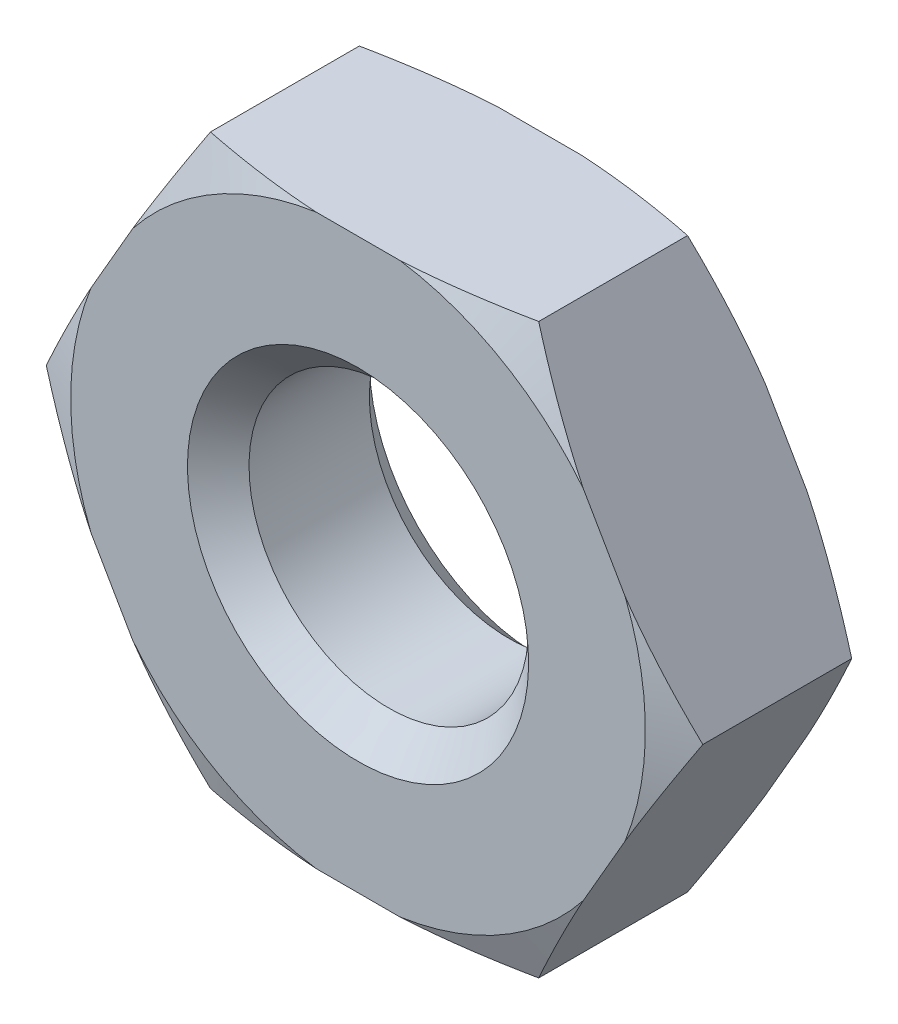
ISO-10303-21;
HEADER;
FILE_DESCRIPTION(('STEP AP214'),'2;1');
FILE_NAME('part.step','',(''),(''),'','','');
FILE_SCHEMA(('AUTOMOTIVE_DESIGN { 1 0 10303 214 1 1 1 1 }'));
ENDSEC;
DATA;
#1=APPLICATION_CONTEXT('core data for automotive mechanical design processes');
#2=APPLICATION_PROTOCOL_DEFINITION('international standard','automotive_design',2000,#1);
#3=PRODUCT_CONTEXT('',#1,'mechanical');
#4=PRODUCT('Part','Part','',(#3));
#5=PRODUCT_RELATED_PRODUCT_CATEGORY('part','',(#4));
#6=PRODUCT_DEFINITION_FORMATION('','',#4);
#7=PRODUCT_DEFINITION_CONTEXT('part definition',#1,'design');
#8=PRODUCT_DEFINITION('design','',#6,#7);
#9=PRODUCT_DEFINITION_SHAPE('','',#8);
#10=(LENGTH_UNIT() NAMED_UNIT(*) SI_UNIT(.MILLI.,.METRE.));
#11=(NAMED_UNIT(*) PLANE_ANGLE_UNIT() SI_UNIT($,.RADIAN.));
#12=(NAMED_UNIT(*) SI_UNIT($,.STERADIAN.) SOLID_ANGLE_UNIT());
#13=UNCERTAINTY_MEASURE_WITH_UNIT(LENGTH_MEASURE(1.E-05),#10,'distance_accuracy_value','');
#14=(GEOMETRIC_REPRESENTATION_CONTEXT(3) GLOBAL_UNCERTAINTY_ASSIGNED_CONTEXT((#13)) GLOBAL_UNIT_ASSIGNED_CONTEXT((#10,
#11,#12)) REPRESENTATION_CONTEXT('',''));
#15=CARTESIAN_POINT('',(0.,0.,0.));
#16=DIRECTION('',(0.,0.,1.));
#17=DIRECTION('',(1.,0.,0.));
#18=AXIS2_PLACEMENT_3D('',#15,#16,#17);
#19=CARTESIAN_POINT('',(0.,0.,0.));
#20=DIRECTION('',(0.,0.,1.));
#21=DIRECTION('',(0.,-1.,0.));
#22=AXIS2_PLACEMENT_3D('',#19,#20,#21);
#23=CONICAL_SURFACE('',#22,5.05347473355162,1.18682389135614);
#24=CARTESIAN_POINT('',(4.69673964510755,1.86500364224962,-2.00000000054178E-07));
#25=CARTESIAN_POINT('',(4.78728230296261,1.70817915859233,0.0105818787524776));
#26=CARTESIAN_POINT('',(4.87769671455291,1.55157680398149,0.0250669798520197));
#27=CARTESIAN_POINT('',(5.05806042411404,1.23917769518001,0.0611124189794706));
#28=CARTESIAN_POINT('',(5.1480101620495,1.08338017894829,0.0826638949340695));
#29=CARTESIAN_POINT('',(5.32744099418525,0.772596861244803,0.132135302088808));
#30=CARTESIAN_POINT('',(5.4169221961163,0.617610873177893,0.16005369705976));
#31=CARTESIAN_POINT('',(5.59552040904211,0.30826969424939,0.221487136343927));
#32=CARTESIAN_POINT('',(5.68463682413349,0.153915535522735,0.255009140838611));
#33=CARTESIAN_POINT('',(5.77350011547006,-2.0000000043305E-07,0.290909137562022));
#34=B_SPLINE_CURVE_WITH_KNOTS('',3,(#24,#25,#26,#27,#28,#29,#30,#31,#32,#33),.UNSPECIFIED.,.F.,
.F.,(4,2,2,2,4),(0.,0.544100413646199,1.08752105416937,1.63081071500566,2.17478027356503),.UNSPECIFIED.);
#35=CARTESIAN_POINT('',(4.6967413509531,1.86500068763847,0.));
#36=VERTEX_POINT('',#35);
#37=CARTESIAN_POINT('',(5.7735,0.,0.290909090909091));
#38=VERTEX_POINT('',#37);
#39=EDGE_CURVE('E301',#36,#38,#34,.T.);
#40=ORIENTED_EDGE('',*,*,#39,.T.);
#41=CARTESIAN_POINT('',(5.77350011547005,2.E-07,0.290909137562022));
#42=CARTESIAN_POINT('',(5.68463682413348,-0.153915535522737,0.255009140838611));
#43=CARTESIAN_POINT('',(5.59552040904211,-0.308269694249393,0.221487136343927));
#44=CARTESIAN_POINT('',(5.4169221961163,-0.617610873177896,0.16005369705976));
#45=CARTESIAN_POINT('',(5.32744099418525,-0.772596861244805,0.132135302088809));
#46=CARTESIAN_POINT('',(5.1480101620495,-1.0833801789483,0.0826638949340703));
#47=CARTESIAN_POINT('',(5.05806042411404,-1.23917769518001,0.0611124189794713));
#48=CARTESIAN_POINT('',(4.87769671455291,-1.55157680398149,0.0250669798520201));
#49=CARTESIAN_POINT('',(4.78728230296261,-1.70817915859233,0.0105818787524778));
#50=CARTESIAN_POINT('',(4.69673964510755,-1.86500364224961,-1.99999999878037E-07));
#51=B_SPLINE_CURVE_WITH_KNOTS('',3,(#41,#42,#43,#44,#45,#46,#47,#48,#49,#50),.UNSPECIFIED.,.F.,
.F.,(4,2,2,2,4),(0.,0.543969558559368,1.08725921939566,1.63067985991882,2.17478027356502),.UNSPECIFIED.);
#52=CARTESIAN_POINT('',(4.6967413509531,-1.86500068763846,0.));
#53=VERTEX_POINT('',#52);
#54=EDGE_CURVE('E34',#38,#53,#51,.T.);
#55=ORIENTED_EDGE('',*,*,#54,.T.);
#56=CARTESIAN_POINT('',(0.,0.,0.));
#57=DIRECTION('',(0.,0.,1.));
#58=DIRECTION('',(1.,0.,0.));
#59=AXIS2_PLACEMENT_3D('',#56,#57,#58);
#60=CIRCLE('',#59,5.05347473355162);
#61=EDGE_CURVE('E309',#53,#36,#60,.T.);
#62=ORIENTED_EDGE('',*,*,#61,.T.);
#63=EDGE_LOOP('',(#40,#55,#62));
#64=FACE_BOUND('',#63,.T.);
#65=ADVANCED_FACE('F17',(#64),#23,.T.);
#66=CARTESIAN_POINT('',(5.7735,0.,0.));
#67=DIRECTION('',(0.,0.,1.));
#68=DIRECTION('',(1.,0.,0.));
#69=AXIS2_PLACEMENT_3D('',#66,#67,#68);
#70=PLANE('',#69);
#71=CARTESIAN_POINT('',(0.,0.,0.));
#72=DIRECTION('',(0.,0.,-1.));
#73=DIRECTION('',(0.,1.,0.));
#74=AXIS2_PLACEMENT_3D('',#71,#72,#73);
#75=CIRCLE('',#74,5.05347473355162);
#76=CARTESIAN_POINT('',(0.733232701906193,4.99999766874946,0.));
#77=VERTEX_POINT('',#76);
#78=CARTESIAN_POINT('',(3.9635086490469,3.134996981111,0.));
#79=VERTEX_POINT('',#78);
#80=EDGE_CURVE('E152',#77,#79,#75,.T.);
#81=ORIENTED_EDGE('',*,*,#80,.T.);
#82=DIRECTION('',(-0.5,0.866025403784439,0.));
#83=VECTOR('',#82,1.);
#84=CARTESIAN_POINT('',(5.7735,0.,0.));
#85=LINE('',#84,#83);
#86=EDGE_CURVE('E158',#36,#79,#85,.T.);
#87=ORIENTED_EDGE('',*,*,#86,.F.);
#88=ORIENTED_EDGE('',*,*,#61,.F.);
#89=DIRECTION('',(0.5,0.866025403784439,0.));
#90=VECTOR('',#89,1.);
#91=CARTESIAN_POINT('',(2.88675,-4.99999766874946,0.));
#92=LINE('',#91,#90);
#93=CARTESIAN_POINT('',(3.9635086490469,-3.134996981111,0.));
#94=VERTEX_POINT('',#93);
#95=EDGE_CURVE('E346',#94,#53,#92,.T.);
#96=ORIENTED_EDGE('',*,*,#95,.F.);
#97=CARTESIAN_POINT('',(0.733232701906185,-4.99999766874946,0.));
#98=VERTEX_POINT('',#97);
#99=EDGE_CURVE('E310',#98,#94,#60,.T.);
#100=ORIENTED_EDGE('',*,*,#99,.F.);
#101=DIRECTION('',(1.,0.,0.));
#102=VECTOR('',#101,1.);
#103=CARTESIAN_POINT('',(-2.88675,-4.99999766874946,0.));
#104=LINE('',#103,#102);
#105=CARTESIAN_POINT('',(-0.733232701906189,-4.99999766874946,0.));
#106=VERTEX_POINT('',#105);
#107=EDGE_CURVE('E333',#106,#98,#104,.T.);
#108=ORIENTED_EDGE('',*,*,#107,.F.);
#109=CARTESIAN_POINT('',(-3.96350864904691,-3.13499698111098,0.));
#110=VERTEX_POINT('',#109);
#111=EDGE_CURVE('E313',#110,#106,#60,.T.);
#112=ORIENTED_EDGE('',*,*,#111,.F.);
#113=DIRECTION('',(0.5,-0.866025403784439,0.));
#114=VECTOR('',#113,1.);
#115=CARTESIAN_POINT('',(-5.7735,0.,0.));
#116=LINE('',#115,#114);
#117=CARTESIAN_POINT('',(-4.69674135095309,-1.86500068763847,0.));
#118=VERTEX_POINT('',#117);
#119=EDGE_CURVE('E330',#118,#110,#116,.T.);
#120=ORIENTED_EDGE('',*,*,#119,.F.);
#121=CARTESIAN_POINT('',(-4.69674135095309,1.86500068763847,0.));
#122=VERTEX_POINT('',#121);
#123=EDGE_CURVE('E315',#122,#118,#60,.T.);
#124=ORIENTED_EDGE('',*,*,#123,.F.);
#125=DIRECTION('',(-0.5,-0.866025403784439,0.));
#126=VECTOR('',#125,1.);
#127=CARTESIAN_POINT('',(-2.88675,4.99999766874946,0.));
#128=LINE('',#127,#126);
#129=CARTESIAN_POINT('',(-3.9635086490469,3.13499698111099,0.));
#130=VERTEX_POINT('',#129);
#131=EDGE_CURVE('E157',#130,#122,#128,.T.);
#132=ORIENTED_EDGE('',*,*,#131,.F.);
#133=CARTESIAN_POINT('',(-0.73323270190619,4.99999766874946,0.));
#134=VERTEX_POINT('',#133);
#135=EDGE_CURVE('E154',#134,#130,#60,.T.);
#136=ORIENTED_EDGE('',*,*,#135,.F.);
#137=DIRECTION('',(-1.,0.,0.));
#138=VECTOR('',#137,1.);
#139=CARTESIAN_POINT('',(2.88675,4.99999766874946,0.));
#140=LINE('',#139,#138);
#141=EDGE_CURVE('E147',#77,#134,#140,.T.);
#142=ORIENTED_EDGE('',*,*,#141,.F.);
#143=EDGE_LOOP('',(#81,#87,#88,#96,#100,#108,#112,#120,#124,#132,#136,#142));
#144=FACE_BOUND('',#143,.T.);
#145=CARTESIAN_POINT('',(0.,0.,0.));
#146=DIRECTION('',(0.,0.,-1.));
#147=DIRECTION('',(0.,1.,0.));
#148=AXIS2_PLACEMENT_3D('',#145,#146,#147);
#149=CIRCLE('',#148,3.);
#150=CARTESIAN_POINT('',(0.,3.,0.));
#151=VERTEX_POINT('',#150);
#152=EDGE_CURVE('E170',#151,#151,#149,.T.);
#153=ORIENTED_EDGE('',*,*,#152,.F.);
#154=EDGE_LOOP('',(#153));
#155=FACE_BOUND('',#154,.T.);
#156=ADVANCED_FACE('F149',(#144,#155),#70,.F.);
#157=CARTESIAN_POINT('',(2.88675,-4.99999766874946,3.2));
#158=DIRECTION('',(-0.866025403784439,0.5,0.));
#159=DIRECTION('',(-0.5,-0.866025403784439,0.));
#160=AXIS2_PLACEMENT_3D('',#157,#158,#159);
#161=PLANE('',#160);
#162=CARTESIAN_POINT('',(4.69673964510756,-1.86500364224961,3.2000002));
#163=CARTESIAN_POINT('',(4.78728230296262,-1.70817915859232,3.18941812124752));
#164=CARTESIAN_POINT('',(4.87769671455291,-1.55157680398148,3.17493302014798));
#165=CARTESIAN_POINT('',(5.05806042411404,-1.23917769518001,3.13888758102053));
#166=CARTESIAN_POINT('',(5.1480101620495,-1.08338017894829,3.11733610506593));
#167=CARTESIAN_POINT('',(5.32744099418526,-0.772596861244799,3.06786469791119));
#168=CARTESIAN_POINT('',(5.41692219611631,-0.61761087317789,3.03994630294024));
#169=CARTESIAN_POINT('',(5.59552040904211,-0.308269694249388,2.97851286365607));
#170=CARTESIAN_POINT('',(5.68463682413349,-0.153915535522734,2.94499085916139));
#171=CARTESIAN_POINT('',(5.77350011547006,1.99999999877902E-07,2.90909086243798));
#172=B_SPLINE_CURVE_WITH_KNOTS('',3,(#162,#163,#164,#165,#166,#167,#168,#169,#170,#171),
.UNSPECIFIED.,.F.,.F.,(4,2,2,2,4),(0.,0.544100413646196,1.08752105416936,1.63081071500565,
2.17478027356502),.UNSPECIFIED.);
#173=CARTESIAN_POINT('',(4.6967413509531,-1.86500068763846,3.2));
#174=VERTEX_POINT('',#173);
#175=CARTESIAN_POINT('',(5.7735,0.,2.90909090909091));
#176=VERTEX_POINT('',#175);
#177=EDGE_CURVE('E285',#174,#176,#172,.T.);
#178=ORIENTED_EDGE('',*,*,#177,.F.);
#179=DIRECTION('',(0.5,0.866025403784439,0.));
#180=VECTOR('',#179,1.);
#181=CARTESIAN_POINT('',(2.88675,-4.99999766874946,3.2));
#182=LINE('',#181,#180);
#183=CARTESIAN_POINT('',(3.9635086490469,-3.134996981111,3.2));
#184=VERTEX_POINT('',#183);
#185=EDGE_CURVE('E341',#184,#174,#182,.T.);
#186=ORIENTED_EDGE('',*,*,#185,.F.);
#187=CARTESIAN_POINT('',(2.88674988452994,-4.99999786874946,2.90909086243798));
#188=CARTESIAN_POINT('',(2.97561317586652,-4.84608213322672,2.94499085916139));
#189=CARTESIAN_POINT('',(3.06472959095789,-4.69172797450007,2.97851286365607));
#190=CARTESIAN_POINT('',(3.24332780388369,-4.38238679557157,3.03994630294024));
#191=CARTESIAN_POINT('',(3.33280900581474,-4.22740080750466,3.06786469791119));
#192=CARTESIAN_POINT('',(3.5122398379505,-3.91661748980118,3.11733610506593));
#193=CARTESIAN_POINT('',(3.60218957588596,-3.76081997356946,3.13888758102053));
#194=CARTESIAN_POINT('',(3.78255328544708,-3.44842086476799,3.17493302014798));
#195=CARTESIAN_POINT('',(3.87296769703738,-3.29181851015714,3.18941812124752));
#196=CARTESIAN_POINT('',(3.96351035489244,-3.13499402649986,3.2000002));
#197=B_SPLINE_CURVE_WITH_KNOTS('',3,(#187,#188,#189,#190,#191,#192,#193,#194,#195,#196),
.UNSPECIFIED.,.F.,.F.,(4,2,2,2,4),(0.,0.543969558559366,1.08725921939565,1.63067985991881,
2.17478027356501),.UNSPECIFIED.);
#198=CARTESIAN_POINT('',(2.88675,-4.99999766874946,2.90909090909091));
#199=VERTEX_POINT('',#198);
#200=EDGE_CURVE('E220',#199,#184,#197,.T.);
#201=ORIENTED_EDGE('',*,*,#200,.F.);
#202=DIRECTION('',(0.,0.,-1.));
#203=VECTOR('',#202,1.);
#204=CARTESIAN_POINT('',(2.88675,-4.99999766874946,3.2));
#205=LINE('',#204,#203);
#206=CARTESIAN_POINT('',(2.88675,-4.99999766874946,0.290909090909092));
#207=VERTEX_POINT('',#206);
#208=EDGE_CURVE('E363',#199,#207,#205,.T.);
#209=ORIENTED_EDGE('',*,*,#208,.T.);
#210=CARTESIAN_POINT('',(3.96351035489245,-3.13499402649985,-1.99999999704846E-07));
#211=CARTESIAN_POINT('',(3.87296769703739,-3.29181851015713,0.0105818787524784));
#212=CARTESIAN_POINT('',(3.78255328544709,-3.44842086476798,0.0250669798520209));
#213=CARTESIAN_POINT('',(3.60218957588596,-3.76081997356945,0.0611124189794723));
#214=CARTESIAN_POINT('',(3.5122398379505,-3.91661748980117,0.0826638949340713));
#215=CARTESIAN_POINT('',(3.33280900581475,-4.22740080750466,0.13213530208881));
#216=CARTESIAN_POINT('',(3.2433278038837,-4.38238679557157,0.160053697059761));
#217=CARTESIAN_POINT('',(3.06472959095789,-4.69172797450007,0.221487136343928));
#218=CARTESIAN_POINT('',(2.97561317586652,-4.84608213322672,0.255009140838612));
#219=CARTESIAN_POINT('',(2.88674988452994,-4.99999786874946,0.290909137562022));
#220=B_SPLINE_CURVE_WITH_KNOTS('',3,(#210,#211,#212,#213,#214,#215,#216,#217,#218,#219),
.UNSPECIFIED.,.F.,.F.,(4,2,2,2,4),(0.,0.544100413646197,1.08752105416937,1.63081071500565,
2.17478027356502),.UNSPECIFIED.);
#221=EDGE_CURVE('E428',#94,#207,#220,.T.);
#222=ORIENTED_EDGE('',*,*,#221,.F.);
#223=ORIENTED_EDGE('',*,*,#95,.T.);
#224=ORIENTED_EDGE('',*,*,#54,.F.);
#225=DIRECTION('',(0.,0.,-1.));
#226=VECTOR('',#225,1.);
#227=CARTESIAN_POINT('',(5.7735,0.,3.2));
#228=LINE('',#227,#226);
#229=EDGE_CURVE('E311',#176,#38,#228,.T.);
#230=ORIENTED_EDGE('',*,*,#229,.F.);
#231=EDGE_LOOP('',(#178,#186,#201,#209,#222,#223,#224,#230));
#232=FACE_BOUND('',#231,.T.);
#233=ADVANCED_FACE('F19',(#232),#161,.F.);
#234=CARTESIAN_POINT('',(5.7735,0.,3.2));
#235=DIRECTION('',(-0.866025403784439,-0.5,0.));
#236=DIRECTION('',(0.5,-0.866025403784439,0.));
#237=AXIS2_PLACEMENT_3D('',#234,#235,#236);
#238=PLANE('',#237);
#239=CARTESIAN_POINT('',(3.96351035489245,3.13499402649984,3.2000002));
#240=CARTESIAN_POINT('',(3.87296769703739,3.29181851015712,3.18941812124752));
#241=CARTESIAN_POINT('',(3.78255328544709,3.44842086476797,3.17493302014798));
#242=CARTESIAN_POINT('',(3.60218957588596,3.76081997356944,3.13888758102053));
#243=CARTESIAN_POINT('',(3.51223983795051,3.91661748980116,3.11733610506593));
#244=CARTESIAN_POINT('',(3.33280900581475,4.22740080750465,3.06786469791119));
#245=CARTESIAN_POINT('',(3.2433278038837,4.38238679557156,3.03994630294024));
#246=CARTESIAN_POINT('',(3.06472959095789,4.69172797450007,2.97851286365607));
#247=CARTESIAN_POINT('',(2.97561317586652,4.84608213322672,2.94499085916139));
#248=CARTESIAN_POINT('',(2.88674988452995,4.99999786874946,2.90909086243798));
#249=B_SPLINE_CURVE_WITH_KNOTS('',3,(#239,#240,#241,#242,#243,#244,#245,#246,#247,#248),
.UNSPECIFIED.,.F.,.F.,(4,2,2,2,4),(0.,0.544100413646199,1.08752105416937,1.63081071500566,
2.17478027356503),.UNSPECIFIED.);
#250=CARTESIAN_POINT('',(3.9635086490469,3.134996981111,3.2));
#251=VERTEX_POINT('',#250);
#252=CARTESIAN_POINT('',(2.88675,4.99999766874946,2.90909090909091));
#253=VERTEX_POINT('',#252);
#254=EDGE_CURVE('E276',#251,#253,#249,.T.);
#255=ORIENTED_EDGE('',*,*,#254,.F.);
#256=DIRECTION('',(-0.5,0.866025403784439,0.));
#257=VECTOR('',#256,1.);
#258=CARTESIAN_POINT('',(5.7735,0.,3.2));
#259=LINE('',#258,#257);
#260=CARTESIAN_POINT('',(4.6967413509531,1.86500068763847,3.2));
#261=VERTEX_POINT('',#260);
#262=EDGE_CURVE('E348',#261,#251,#259,.T.);
#263=ORIENTED_EDGE('',*,*,#262,.F.);
#264=CARTESIAN_POINT('',(5.77350011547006,-2.00000000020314E-07,2.90909086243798));
#265=CARTESIAN_POINT('',(5.68463682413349,0.153915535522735,2.94499085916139));
#266=CARTESIAN_POINT('',(5.59552040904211,0.30826969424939,2.97851286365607));
#267=CARTESIAN_POINT('',(5.4169221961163,0.617610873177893,3.03994630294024));
#268=CARTESIAN_POINT('',(5.32744099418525,0.772596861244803,3.06786469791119));
#269=CARTESIAN_POINT('',(5.1480101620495,1.08338017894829,3.11733610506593));
#270=CARTESIAN_POINT('',(5.05806042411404,1.23917769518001,3.13888758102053));
#271=CARTESIAN_POINT('',(4.87769671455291,1.55157680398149,3.17493302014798));
#272=CARTESIAN_POINT('',(4.78728230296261,1.70817915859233,3.18941812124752));
#273=CARTESIAN_POINT('',(4.69673964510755,1.86500364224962,3.2000002));
#274=B_SPLINE_CURVE_WITH_KNOTS('',3,(#264,#265,#266,#267,#268,#269,#270,#271,#272,#273),
.UNSPECIFIED.,.F.,.F.,(4,2,2,2,4),(0.,0.543969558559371,1.08725921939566,1.63067985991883,
2.17478027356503),.UNSPECIFIED.);
#275=EDGE_CURVE('E281',#176,#261,#274,.T.);
#276=ORIENTED_EDGE('',*,*,#275,.F.);
#277=ORIENTED_EDGE('',*,*,#229,.T.);
#278=ORIENTED_EDGE('',*,*,#39,.F.);
#279=ORIENTED_EDGE('',*,*,#86,.T.);
#280=CARTESIAN_POINT('',(2.88674988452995,4.99999786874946,0.290909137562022));
#281=CARTESIAN_POINT('',(2.97561317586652,4.84608213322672,0.255009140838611));
#282=CARTESIAN_POINT('',(3.06472959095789,4.69172797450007,0.221487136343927));
#283=CARTESIAN_POINT('',(3.2433278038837,4.38238679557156,0.16005369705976));
#284=CARTESIAN_POINT('',(3.33280900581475,4.22740080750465,0.132135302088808));
#285=CARTESIAN_POINT('',(3.51223983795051,3.91661748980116,0.0826638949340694));
#286=CARTESIAN_POINT('',(3.60218957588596,3.76081997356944,0.0611124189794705));
#287=CARTESIAN_POINT('',(3.78255328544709,3.44842086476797,0.0250669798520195));
#288=CARTESIAN_POINT('',(3.87296769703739,3.29181851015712,0.0105818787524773));
#289=CARTESIAN_POINT('',(3.96351035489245,3.13499402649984,-2.00000000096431E-07));
#290=B_SPLINE_CURVE_WITH_KNOTS('',3,(#280,#281,#282,#283,#284,#285,#286,#287,#288,#289),
.UNSPECIFIED.,.F.,.F.,(4,2,2,2,4),(0.,0.543969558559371,1.08725921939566,1.63067985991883,
2.17478027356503),.UNSPECIFIED.);
#291=CARTESIAN_POINT('',(2.88675,4.99999766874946,0.290909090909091));
#292=VERTEX_POINT('',#291);
#293=EDGE_CURVE('E42',#292,#79,#290,.T.);
#294=ORIENTED_EDGE('',*,*,#293,.F.);
#295=DIRECTION('',(0.,0.,-1.));
#296=VECTOR('',#295,1.);
#297=CARTESIAN_POINT('',(2.88675,4.99999766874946,3.2));
#298=LINE('',#297,#296);
#299=EDGE_CURVE('E164',#253,#292,#298,.T.);
#300=ORIENTED_EDGE('',*,*,#299,.F.);
#301=EDGE_LOOP('',(#255,#263,#276,#277,#278,#279,#294,#300));
#302=FACE_BOUND('',#301,.T.);
#303=ADVANCED_FACE('F290',(#302),#238,.F.);
#304=CARTESIAN_POINT('',(2.88675,4.99999766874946,3.2));
#305=DIRECTION('',(0.,-1.,0.));
#306=DIRECTION('',(1.,0.,0.));
#307=AXIS2_PLACEMENT_3D('',#304,#305,#306);
#308=PLANE('',#307);
#309=CARTESIAN_POINT('',(-7.6494870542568,4.99999766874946,1.54948857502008));
#310=CARTESIAN_POINT('',(-7.42376492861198,4.99999766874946,1.62580385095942));
#311=CARTESIAN_POINT('',(-7.19774364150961,4.99999766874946,1.70125051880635));
#312=CARTESIAN_POINT('',(-6.74494791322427,4.99999766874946,1.84992142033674));
#313=CARTESIAN_POINT('',(-6.51817340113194,4.99999766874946,1.92314543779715));
#314=CARTESIAN_POINT('',(-6.06321673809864,4.99999766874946,2.06704269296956));
#315=CARTESIAN_POINT('',(-5.83503251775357,4.99999766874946,2.13770941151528));
#316=CARTESIAN_POINT('',(-5.37763676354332,4.99999766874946,2.27562907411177));
#317=CARTESIAN_POINT('',(-5.14842525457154,4.99999766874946,2.34288210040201));
#318=CARTESIAN_POINT('',(-4.69172212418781,4.99999766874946,2.47228254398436));
#319=CARTESIAN_POINT('',(-4.46424595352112,4.99999766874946,2.53448422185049));
#320=CARTESIAN_POINT('',(-4.00791262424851,4.99999766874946,2.65366439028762));
#321=CARTESIAN_POINT('',(-3.7790554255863,4.99999766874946,2.71064272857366));
#322=CARTESIAN_POINT('',(-3.3199230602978,4.99999766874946,2.81802184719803));
#323=CARTESIAN_POINT('',(-3.0896487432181,4.99999766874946,2.86842622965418));
#324=CARTESIAN_POINT('',(-2.62746239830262,4.99999766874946,2.9611050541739));
#325=CARTESIAN_POINT('',(-2.39555048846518,4.99999766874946,3.00338007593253));
#326=CARTESIAN_POINT('',(-1.9776855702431,4.99999766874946,3.07040615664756));
#327=CARTESIAN_POINT('',(-1.79202529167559,4.99999766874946,3.09697287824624));
#328=CARTESIAN_POINT('',(-1.41982575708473,4.99999766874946,3.14295683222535));
#329=CARTESIAN_POINT('',(-1.23328657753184,4.99999766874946,3.16237467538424));
#330=CARTESIAN_POINT('',(-0.859662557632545,4.99999766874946,3.19329541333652));
#331=CARTESIAN_POINT('',(-0.672578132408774,4.99999766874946,3.20480325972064));
#332=CARTESIAN_POINT('',(-0.298078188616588,4.99999766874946,3.2194204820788));
#333=CARTESIAN_POINT('',(-0.110662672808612,4.99999766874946,3.22252992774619));
#334=CARTESIAN_POINT('',(0.265016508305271,4.99999766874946,3.22020109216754));
#335=CARTESIAN_POINT('',(0.453279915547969,4.99999766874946,3.21472161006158));
#336=CARTESIAN_POINT('',(0.829373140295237,4.99999766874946,3.19539105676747));
#337=CARTESIAN_POINT('',(1.01720295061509,4.99999766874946,3.18153984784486));
#338=CARTESIAN_POINT('',(1.39223727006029,4.99999766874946,3.14605004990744));
#339=CARTESIAN_POINT('',(1.57944130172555,4.99999766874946,3.12440647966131));
#340=CARTESIAN_POINT('',(1.95289971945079,4.99999766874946,3.07415251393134));
#341=CARTESIAN_POINT('',(2.13915410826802,4.99999766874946,3.04554213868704));
#342=CARTESIAN_POINT('',(2.54191943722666,4.99999766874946,2.97693307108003));
#343=CARTESIAN_POINT('',(2.75824063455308,4.99999766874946,2.93582777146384));
#344=CARTESIAN_POINT('',(3.18947161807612,4.99999766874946,2.84676566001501));
#345=CARTESIAN_POINT('',(3.404381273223,4.99999766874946,2.79880822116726));
#346=CARTESIAN_POINT('',(3.83297909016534,4.99999766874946,2.69728359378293));
#347=CARTESIAN_POINT('',(4.04666656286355,4.99999766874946,2.64371351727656));
#348=CARTESIAN_POINT('',(4.47284023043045,4.99999766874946,2.53204916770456));
#349=CARTESIAN_POINT('',(4.68532647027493,4.99999766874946,2.47395506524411));
#350=CARTESIAN_POINT('',(5.10982164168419,4.99999766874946,2.35394650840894));
#351=CARTESIAN_POINT('',(5.3218278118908,4.99999766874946,2.29202232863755));
#352=CARTESIAN_POINT('',(5.74494356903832,4.99999766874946,2.16518095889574));
#353=CARTESIAN_POINT('',(5.95605313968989,4.99999766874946,2.10026371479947));
#354=CARTESIAN_POINT('',(6.58811681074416,4.99999766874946,1.90191635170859));
#355=CARTESIAN_POINT('',(7.00793020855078,4.99999766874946,1.76485470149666));
#356=CARTESIAN_POINT('',(7.84262861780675,4.99999766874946,1.48509282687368));
#357=CARTESIAN_POINT('',(8.25752793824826,4.99999766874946,1.34243487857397));
#358=CARTESIAN_POINT('',(9.08575676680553,4.99999766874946,1.05254341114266));
#359=CARTESIAN_POINT('',(9.49908615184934,4.99999766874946,0.905309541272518));
#360=CARTESIAN_POINT('',(10.3217912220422,4.99999766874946,0.608534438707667));
#361=CARTESIAN_POINT('',(10.7311748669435,4.99999766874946,0.459015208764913));
#362=CARTESIAN_POINT('',(11.3445503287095,4.99999766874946,0.232921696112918));
#363=CARTESIAN_POINT('',(11.5488792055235,4.99999766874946,0.157259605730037));
#364=CARTESIAN_POINT('',(11.9573377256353,4.99999766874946,0.00540172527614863));
#365=CARTESIAN_POINT('',(12.1614673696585,4.99999766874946,-0.0707940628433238));
#366=CARTESIAN_POINT('',(12.365510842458,4.99999766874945,-0.147219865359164));
#367=B_SPLINE_CURVE_WITH_KNOTS('',3,(#309,#310,#311,#312,#313,#314,#315,#316,#317,#318,#319,
#320,#321,#322,#323,#324,#325,#326,#327,#328,#329,#330,#331,#332,#333,#334,#335,#336,#337,#338,
#339,#340,#341,#342,#343,#344,#345,#346,#347,#348,#349,#350,#351,#352,#353,#354,#355,#356,#357,
#358,#359,#360,#361,#362,#363,#364,#365,#366),.UNSPECIFIED.,.F.,.F.,(4,2,2,2,2,2,2,2,2,2,2,2,2,
2,2,2,2,2,2,2,2,2,2,2,2,2,2,2,4),(0.,0.714828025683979,1.42972536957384,2.14633243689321,
2.86292223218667,3.57035502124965,4.27780842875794,4.9848725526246,5.69188623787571,
6.25442109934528,6.81690788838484,7.37904224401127,7.94117193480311,8.50600641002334,
9.0708501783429,9.63605566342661,10.2012595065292,10.861696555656,11.5221940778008,
12.1830331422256,12.8438472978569,13.5064143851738,14.1689934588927,15.4937634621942,
16.8099520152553,18.1262417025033,19.4337325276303,20.0873949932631,20.7410550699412),.UNSPECIFIED.);
#368=CARTESIAN_POINT('',(0.733232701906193,4.99999766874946,3.2));
#369=VERTEX_POINT('',#368);
#370=EDGE_CURVE('E452',#253,#369,#367,.F.);
#371=ORIENTED_EDGE('',*,*,#370,.F.);
#372=ORIENTED_EDGE('',*,*,#299,.T.);
#373=CARTESIAN_POINT('',(-7.6494870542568,4.99999766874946,1.65051142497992));
#374=CARTESIAN_POINT('',(-7.42376492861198,4.99999766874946,1.57419614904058));
#375=CARTESIAN_POINT('',(-7.19774364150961,4.99999766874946,1.49874948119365));
#376=CARTESIAN_POINT('',(-6.74494791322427,4.99999766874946,1.35007857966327));
#377=CARTESIAN_POINT('',(-6.51817340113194,4.99999766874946,1.27685456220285));
#378=CARTESIAN_POINT('',(-6.06321673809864,4.99999766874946,1.13295730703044));
#379=CARTESIAN_POINT('',(-5.83503251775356,4.99999766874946,1.06229058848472));
#380=CARTESIAN_POINT('',(-5.37763676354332,4.99999766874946,0.924370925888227));
#381=CARTESIAN_POINT('',(-5.14842525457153,4.99999766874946,0.857117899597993));
#382=CARTESIAN_POINT('',(-4.6917221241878,4.99999766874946,0.727717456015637));
#383=CARTESIAN_POINT('',(-4.46424595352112,4.99999766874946,0.665515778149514));
#384=CARTESIAN_POINT('',(-4.00791262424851,4.99999766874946,0.546335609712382));
#385=CARTESIAN_POINT('',(-3.7790554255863,4.99999766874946,0.489357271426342));
#386=CARTESIAN_POINT('',(-3.3199230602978,4.99999766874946,0.381978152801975));
#387=CARTESIAN_POINT('',(-3.0896487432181,4.99999766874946,0.331573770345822));
#388=CARTESIAN_POINT('',(-2.62746239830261,4.99999766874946,0.238894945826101));
#389=CARTESIAN_POINT('',(-2.39555048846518,4.99999766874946,0.196619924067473));
#390=CARTESIAN_POINT('',(-1.9776855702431,4.99999766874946,0.129593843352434));
#391=CARTESIAN_POINT('',(-1.79202529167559,4.99999766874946,0.103027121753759));
#392=CARTESIAN_POINT('',(-1.41982575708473,4.99999766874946,0.0570431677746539));
#393=CARTESIAN_POINT('',(-1.23328657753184,4.99999766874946,0.0376253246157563));
#394=CARTESIAN_POINT('',(-0.859662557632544,4.99999766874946,0.00670458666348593));
#395=CARTESIAN_POINT('',(-0.672578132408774,4.99999766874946,-0.00480325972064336));
#396=CARTESIAN_POINT('',(-0.298078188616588,4.99999766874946,-0.0194204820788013));
#397=CARTESIAN_POINT('',(-0.110662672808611,4.99999766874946,-0.0225299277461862));
#398=CARTESIAN_POINT('',(0.265016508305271,4.99999766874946,-0.0202010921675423));
#399=CARTESIAN_POINT('',(0.453279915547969,4.99999766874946,-0.0147216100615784));
#400=CARTESIAN_POINT('',(0.829373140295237,4.99999766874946,0.00460894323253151));
#401=CARTESIAN_POINT('',(1.01720295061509,4.99999766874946,0.018460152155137));
#402=CARTESIAN_POINT('',(1.39223727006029,4.99999766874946,0.0539499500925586));
#403=CARTESIAN_POINT('',(1.57944130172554,4.99999766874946,0.0755935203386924));
#404=CARTESIAN_POINT('',(1.95289971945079,4.99999766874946,0.125847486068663));
#405=CARTESIAN_POINT('',(2.13915410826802,4.99999766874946,0.15445786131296));
#406=CARTESIAN_POINT('',(2.54191943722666,4.99999766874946,0.223066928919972));
#407=CARTESIAN_POINT('',(2.75824063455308,4.99999766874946,0.264172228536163));
#408=CARTESIAN_POINT('',(3.18947161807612,4.99999766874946,0.353234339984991));
#409=CARTESIAN_POINT('',(3.404381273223,4.99999766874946,0.401191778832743));
#410=CARTESIAN_POINT('',(3.83297909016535,4.99999766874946,0.502716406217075));
#411=CARTESIAN_POINT('',(4.04666656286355,4.99999766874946,0.556286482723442));
#412=CARTESIAN_POINT('',(4.47284023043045,4.99999766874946,0.667950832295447));
#413=CARTESIAN_POINT('',(4.68532647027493,4.99999766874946,0.726044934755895));
#414=CARTESIAN_POINT('',(5.10982164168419,4.99999766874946,0.846053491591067));
#415=CARTESIAN_POINT('',(5.3218278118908,4.99999766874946,0.907977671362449));
#416=CARTESIAN_POINT('',(5.74494356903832,4.99999766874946,1.03481904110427));
#417=CARTESIAN_POINT('',(5.95605313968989,4.99999766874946,1.09973628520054));
#418=CARTESIAN_POINT('',(6.58811681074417,4.99999766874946,1.29808364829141));
#419=CARTESIAN_POINT('',(7.00793020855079,4.99999766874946,1.43514529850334));
#420=CARTESIAN_POINT('',(7.84262861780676,4.99999766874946,1.71490717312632));
#421=CARTESIAN_POINT('',(8.25752793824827,4.99999766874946,1.85756512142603));
#422=CARTESIAN_POINT('',(9.08575676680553,4.99999766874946,2.14745658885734));
#423=CARTESIAN_POINT('',(9.49908615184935,4.99999766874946,2.29469045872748));
#424=CARTESIAN_POINT('',(10.3217912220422,4.99999766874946,2.59146556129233));
#425=CARTESIAN_POINT('',(10.7311748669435,4.99999766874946,2.74098479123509));
#426=CARTESIAN_POINT('',(11.3445503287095,4.99999766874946,2.96707830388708));
#427=CARTESIAN_POINT('',(11.5488792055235,4.99999766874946,3.04274039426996));
#428=CARTESIAN_POINT('',(11.9573377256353,4.99999766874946,3.19459827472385));
#429=CARTESIAN_POINT('',(12.1614673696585,4.99999766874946,3.27079406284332));
#430=CARTESIAN_POINT('',(12.365510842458,4.99999766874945,3.34721986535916));
#431=B_SPLINE_CURVE_WITH_KNOTS('',3,(#373,#374,#375,#376,#377,#378,#379,#380,#381,#382,#383,
#384,#385,#386,#387,#388,#389,#390,#391,#392,#393,#394,#395,#396,#397,#398,#399,#400,#401,#402,
#403,#404,#405,#406,#407,#408,#409,#410,#411,#412,#413,#414,#415,#416,#417,#418,#419,#420,#421,
#422,#423,#424,#425,#426,#427,#428,#429,#430),.UNSPECIFIED.,.F.,.F.,(4,2,2,2,2,2,2,2,2,2,2,2,2,
2,2,2,2,2,2,2,2,2,2,2,2,2,2,2,4),(0.,0.714828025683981,1.42972536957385,2.14633243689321,
2.86292223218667,3.57035502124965,4.27780842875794,4.9848725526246,5.69188623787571,
6.25442109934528,6.81690788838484,7.37904224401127,7.94117193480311,8.50600641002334,
9.07085017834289,9.63605566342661,10.2012595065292,10.861696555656,11.5221940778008,
12.1830331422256,12.8438472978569,13.5064143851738,14.1689934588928,15.4937634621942,
16.8099520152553,18.1262417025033,19.4337325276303,20.0873949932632,20.7410550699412),.UNSPECIFIED.);
#432=EDGE_CURVE('E161',#77,#292,#431,.T.);
#433=ORIENTED_EDGE('',*,*,#432,.F.);
#434=ORIENTED_EDGE('',*,*,#141,.T.);
#435=CARTESIAN_POINT('',(-2.88675,4.99999766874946,0.290909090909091));
#436=VERTEX_POINT('',#435);
#437=EDGE_CURVE('E166',#436,#134,#431,.T.);
#438=ORIENTED_EDGE('',*,*,#437,.F.);
#439=DIRECTION('',(0.,0.,-1.));
#440=VECTOR('',#439,1.);
#441=CARTESIAN_POINT('',(-2.88675,4.99999766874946,3.2));
#442=LINE('',#441,#440);
#443=CARTESIAN_POINT('',(-2.88675,4.99999766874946,2.90909090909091));
#444=VERTEX_POINT('',#443);
#445=EDGE_CURVE('E372',#444,#436,#442,.T.);
#446=ORIENTED_EDGE('',*,*,#445,.F.);
#447=CARTESIAN_POINT('',(-0.73323270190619,4.99999766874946,3.2));
#448=VERTEX_POINT('',#447);
#449=EDGE_CURVE('E270',#448,#444,#367,.F.);
#450=ORIENTED_EDGE('',*,*,#449,.F.);
#451=DIRECTION('',(-1.,0.,0.));
#452=VECTOR('',#451,1.);
#453=CARTESIAN_POINT('',(2.88675,4.99999766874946,3.2));
#454=LINE('',#453,#452);
#455=EDGE_CURVE('E351',#369,#448,#454,.T.);
#456=ORIENTED_EDGE('',*,*,#455,.F.);
#457=EDGE_LOOP('',(#371,#372,#433,#434,#438,#446,#450,#456));
#458=FACE_BOUND('',#457,.T.);
#459=ADVANCED_FACE('F163',(#458),#308,.F.);
#460=CARTESIAN_POINT('',(-2.88675,4.99999766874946,3.2));
#461=DIRECTION('',(0.866025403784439,-0.5,0.));
#462=DIRECTION('',(0.5,0.866025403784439,0.));
#463=AXIS2_PLACEMENT_3D('',#460,#461,#462);
#464=PLANE('',#463);
#465=CARTESIAN_POINT('',(-4.69673964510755,1.86500364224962,3.2000002));
#466=CARTESIAN_POINT('',(-4.78728230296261,1.70817915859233,3.18941812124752));
#467=CARTESIAN_POINT('',(-4.87769671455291,1.55157680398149,3.17493302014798));
#468=CARTESIAN_POINT('',(-5.05806042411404,1.23917769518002,3.13888758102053));
#469=CARTESIAN_POINT('',(-5.1480101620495,1.0833801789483,3.11733610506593));
#470=CARTESIAN_POINT('',(-5.32744099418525,0.772596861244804,3.06786469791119));
#471=CARTESIAN_POINT('',(-5.4169221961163,0.617610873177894,3.03994630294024));
#472=CARTESIAN_POINT('',(-5.59552040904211,0.308269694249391,2.97851286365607));
#473=CARTESIAN_POINT('',(-5.68463682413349,0.153915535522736,2.94499085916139));
#474=CARTESIAN_POINT('',(-5.77350011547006,-1.99999999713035E-07,2.90909086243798));
#475=B_SPLINE_CURVE_WITH_KNOTS('',3,(#465,#466,#467,#468,#469,#470,#471,#472,#473,#474),
.UNSPECIFIED.,.F.,.F.,(4,2,2,2,4),(0.,0.544100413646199,1.08752105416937,1.63081071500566,
2.17478027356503),.UNSPECIFIED.);
#476=CARTESIAN_POINT('',(-4.69674135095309,1.86500068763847,3.2));
#477=VERTEX_POINT('',#476);
#478=CARTESIAN_POINT('',(-5.7735,0.,2.90909090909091));
#479=VERTEX_POINT('',#478);
#480=EDGE_CURVE('E258',#477,#479,#475,.T.);
#481=ORIENTED_EDGE('',*,*,#480,.F.);
#482=DIRECTION('',(-0.5,-0.866025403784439,0.));
#483=VECTOR('',#482,1.);
#484=CARTESIAN_POINT('',(-2.88675,4.99999766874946,3.2));
#485=LINE('',#484,#483);
#486=CARTESIAN_POINT('',(-3.9635086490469,3.13499698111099,3.2));
#487=VERTEX_POINT('',#486);
#488=EDGE_CURVE('E354',#487,#477,#485,.T.);
#489=ORIENTED_EDGE('',*,*,#488,.F.);
#490=CARTESIAN_POINT('',(-2.88674988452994,4.99999786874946,2.90909086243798));
#491=CARTESIAN_POINT('',(-2.97561317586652,4.84608213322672,2.94499085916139));
#492=CARTESIAN_POINT('',(-3.06472959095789,4.69172797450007,2.97851286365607));
#493=CARTESIAN_POINT('',(-3.2433278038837,4.38238679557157,3.03994630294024));
#494=CARTESIAN_POINT('',(-3.33280900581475,4.22740080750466,3.06786469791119));
#495=CARTESIAN_POINT('',(-3.5122398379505,3.91661748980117,3.11733610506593));
#496=CARTESIAN_POINT('',(-3.60218957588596,3.76081997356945,3.13888758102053));
#497=CARTESIAN_POINT('',(-3.78255328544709,3.44842086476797,3.17493302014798));
#498=CARTESIAN_POINT('',(-3.87296769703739,3.29181851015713,3.18941812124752));
#499=CARTESIAN_POINT('',(-3.96351035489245,3.13499402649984,3.2000002));
#500=B_SPLINE_CURVE_WITH_KNOTS('',3,(#490,#491,#492,#493,#494,#495,#496,#497,#498,#499),
.UNSPECIFIED.,.F.,.F.,(4,2,2,2,4),(0.,0.54396955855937,1.08725921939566,1.63067985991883,
2.17478027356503),.UNSPECIFIED.);
#501=EDGE_CURVE('E264',#444,#487,#500,.T.);
#502=ORIENTED_EDGE('',*,*,#501,.F.);
#503=ORIENTED_EDGE('',*,*,#445,.T.);
#504=CARTESIAN_POINT('',(-3.96351035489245,3.13499402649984,-2.E-07));
#505=CARTESIAN_POINT('',(-3.87296769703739,3.29181851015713,0.0105818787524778));
#506=CARTESIAN_POINT('',(-3.78255328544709,3.44842086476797,0.0250669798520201));
#507=CARTESIAN_POINT('',(-3.60218957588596,3.76081997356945,0.0611124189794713));
#508=CARTESIAN_POINT('',(-3.5122398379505,3.91661748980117,0.0826638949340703));
#509=CARTESIAN_POINT('',(-3.33280900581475,4.22740080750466,0.132135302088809));
#510=CARTESIAN_POINT('',(-3.2433278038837,4.38238679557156,0.16005369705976));
#511=CARTESIAN_POINT('',(-3.06472959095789,4.69172797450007,0.221487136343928));
#512=CARTESIAN_POINT('',(-2.97561317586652,4.84608213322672,0.255009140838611));
#513=CARTESIAN_POINT('',(-2.88674988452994,4.99999786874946,0.290909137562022));
#514=B_SPLINE_CURVE_WITH_KNOTS('',3,(#504,#505,#506,#507,#508,#509,#510,#511,#512,#513),
.UNSPECIFIED.,.F.,.F.,(4,2,2,2,4),(0.,0.544100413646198,1.08752105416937,1.63081071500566,
2.17478027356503),.UNSPECIFIED.);
#515=EDGE_CURVE('E381',#130,#436,#514,.T.);
#516=ORIENTED_EDGE('',*,*,#515,.F.);
#517=ORIENTED_EDGE('',*,*,#131,.T.);
#518=CARTESIAN_POINT('',(-5.77350011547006,-1.99999999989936E-07,0.290909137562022));
#519=CARTESIAN_POINT('',(-5.68463682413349,0.153915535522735,0.255009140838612));
#520=CARTESIAN_POINT('',(-5.59552040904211,0.308269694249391,0.221487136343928));
#521=CARTESIAN_POINT('',(-5.4169221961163,0.617610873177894,0.16005369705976));
#522=CARTESIAN_POINT('',(-5.32744099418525,0.772596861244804,0.132135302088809));
#523=CARTESIAN_POINT('',(-5.1480101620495,1.0833801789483,0.0826638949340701));
#524=CARTESIAN_POINT('',(-5.05806042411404,1.23917769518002,0.0611124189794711));
#525=CARTESIAN_POINT('',(-4.87769671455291,1.55157680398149,0.02506697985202));
#526=CARTESIAN_POINT('',(-4.78728230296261,1.70817915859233,0.0105818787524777));
#527=CARTESIAN_POINT('',(-4.69673964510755,1.86500364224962,-2.00000000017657E-07));
#528=B_SPLINE_CURVE_WITH_KNOTS('',3,(#518,#519,#520,#521,#522,#523,#524,#525,#526,#527),
.UNSPECIFIED.,.F.,.F.,(4,2,2,2,4),(0.,0.543969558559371,1.08725921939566,1.63067985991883,
2.17478027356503),.UNSPECIFIED.);
#529=CARTESIAN_POINT('',(-5.7735,0.,0.290909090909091));
#530=VERTEX_POINT('',#529);
#531=EDGE_CURVE('E385',#530,#122,#528,.T.);
#532=ORIENTED_EDGE('',*,*,#531,.F.);
#533=DIRECTION('',(0.,0.,-1.));
#534=VECTOR('',#533,1.);
#535=CARTESIAN_POINT('',(-5.7735,0.,3.2));
#536=LINE('',#535,#534);
#537=EDGE_CURVE('E370',#479,#530,#536,.T.);
#538=ORIENTED_EDGE('',*,*,#537,.F.);
#539=EDGE_LOOP('',(#481,#489,#502,#503,#516,#517,#532,#538));
#540=FACE_BOUND('',#539,.T.);
#541=ADVANCED_FACE('F380',(#540),#464,.F.);
#542=CARTESIAN_POINT('',(-5.7735,0.,3.2));
#543=DIRECTION('',(0.866025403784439,0.5,0.));
#544=DIRECTION('',(-0.5,0.866025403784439,0.));
#545=AXIS2_PLACEMENT_3D('',#542,#543,#544);
#546=PLANE('',#545);
#547=CARTESIAN_POINT('',(-3.96351035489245,-3.13499402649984,3.2000002));
#548=CARTESIAN_POINT('',(-3.87296769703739,-3.29181851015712,3.18941812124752));
#549=CARTESIAN_POINT('',(-3.78255328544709,-3.44842086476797,3.17493302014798));
#550=CARTESIAN_POINT('',(-3.60218957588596,-3.76081997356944,3.13888758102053));
#551=CARTESIAN_POINT('',(-3.51223983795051,-3.91661748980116,3.11733610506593));
#552=CARTESIAN_POINT('',(-3.33280900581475,-4.22740080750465,3.06786469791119));
#553=CARTESIAN_POINT('',(-3.2433278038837,-4.38238679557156,3.03994630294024));
#554=CARTESIAN_POINT('',(-3.06472959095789,-4.69172797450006,2.97851286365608));
#555=CARTESIAN_POINT('',(-2.97561317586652,-4.84608213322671,2.94499085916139));
#556=CARTESIAN_POINT('',(-2.88674988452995,-4.99999786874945,2.90909086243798));
#557=B_SPLINE_CURVE_WITH_KNOTS('',3,(#547,#548,#549,#550,#551,#552,#553,#554,#555,#556),
.UNSPECIFIED.,.F.,.F.,(4,2,2,2,4),(0.,0.544100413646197,1.08752105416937,1.63081071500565,
2.17478027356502),.UNSPECIFIED.);
#558=CARTESIAN_POINT('',(-3.96350864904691,-3.13499698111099,3.2));
#559=VERTEX_POINT('',#558);
#560=CARTESIAN_POINT('',(-2.88675,-4.99999766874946,2.90909090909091));
#561=VERTEX_POINT('',#560);
#562=EDGE_CURVE('E246',#559,#561,#557,.T.);
#563=ORIENTED_EDGE('',*,*,#562,.F.);
#564=DIRECTION('',(0.5,-0.866025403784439,0.));
#565=VECTOR('',#564,1.);
#566=CARTESIAN_POINT('',(-5.7735,0.,3.2));
#567=LINE('',#566,#565);
#568=CARTESIAN_POINT('',(-4.69674135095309,-1.86500068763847,3.2));
#569=VERTEX_POINT('',#568);
#570=EDGE_CURVE('E357',#569,#559,#567,.T.);
#571=ORIENTED_EDGE('',*,*,#570,.F.);
#572=CARTESIAN_POINT('',(-5.77350011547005,1.99999999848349E-07,2.90909086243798));
#573=CARTESIAN_POINT('',(-5.68463682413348,-0.153915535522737,2.94499085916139));
#574=CARTESIAN_POINT('',(-5.59552040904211,-0.308269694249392,2.97851286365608));
#575=CARTESIAN_POINT('',(-5.4169221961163,-0.617610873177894,3.03994630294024));
#576=CARTESIAN_POINT('',(-5.32744099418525,-0.772596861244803,3.06786469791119));
#577=CARTESIAN_POINT('',(-5.1480101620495,-1.08338017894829,3.11733610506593));
#578=CARTESIAN_POINT('',(-5.05806042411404,-1.23917769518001,3.13888758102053));
#579=CARTESIAN_POINT('',(-4.87769671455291,-1.55157680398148,3.17493302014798));
#580=CARTESIAN_POINT('',(-4.78728230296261,-1.70817915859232,3.18941812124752));
#581=CARTESIAN_POINT('',(-4.69673964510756,-1.86500364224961,3.2000002));
#582=B_SPLINE_CURVE_WITH_KNOTS('',3,(#572,#573,#574,#575,#576,#577,#578,#579,#580,#581),
.UNSPECIFIED.,.F.,.F.,(4,2,2,2,4),(0.,0.543969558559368,1.08725921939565,1.63067985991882,
2.17478027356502),.UNSPECIFIED.);
#583=EDGE_CURVE('E252',#479,#569,#582,.T.);
#584=ORIENTED_EDGE('',*,*,#583,.F.);
#585=ORIENTED_EDGE('',*,*,#537,.T.);
#586=CARTESIAN_POINT('',(-4.69673964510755,-1.86500364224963,-1.99999999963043E-07));
#587=CARTESIAN_POINT('',(-4.78728230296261,-1.70817915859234,0.0105818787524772));
#588=CARTESIAN_POINT('',(-4.8776967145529,-1.5515768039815,0.0250669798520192));
#589=CARTESIAN_POINT('',(-5.05806042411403,-1.23917769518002,0.0611124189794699));
#590=CARTESIAN_POINT('',(-5.14801016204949,-1.0833801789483,0.0826638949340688));
#591=CARTESIAN_POINT('',(-5.32744099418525,-0.772596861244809,0.132135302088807));
#592=CARTESIAN_POINT('',(-5.4169221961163,-0.617610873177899,0.160053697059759));
#593=CARTESIAN_POINT('',(-5.59552040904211,-0.308269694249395,0.221487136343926));
#594=CARTESIAN_POINT('',(-5.68463682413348,-0.153915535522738,0.25500914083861));
#595=CARTESIAN_POINT('',(-5.77350011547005,1.99999999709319E-07,0.290909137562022));
#596=B_SPLINE_CURVE_WITH_KNOTS('',3,(#586,#587,#588,#589,#590,#591,#592,#593,#594,#595),
.UNSPECIFIED.,.F.,.F.,(4,2,2,2,4),(0.,0.5441004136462,1.08752105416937,1.63081071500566,
2.17478027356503),.UNSPECIFIED.);
#597=EDGE_CURVE('E339',#118,#530,#596,.T.);
#598=ORIENTED_EDGE('',*,*,#597,.F.);
#599=ORIENTED_EDGE('',*,*,#119,.T.);
#600=CARTESIAN_POINT('',(-2.88674988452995,-4.99999786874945,0.290909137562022));
#601=CARTESIAN_POINT('',(-2.97561317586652,-4.84608213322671,0.25500914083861));
#602=CARTESIAN_POINT('',(-3.06472959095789,-4.69172797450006,0.221487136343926));
#603=CARTESIAN_POINT('',(-3.2433278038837,-4.38238679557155,0.160053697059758));
#604=CARTESIAN_POINT('',(-3.33280900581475,-4.22740080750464,0.132135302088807));
#605=CARTESIAN_POINT('',(-3.51223983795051,-3.91661748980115,0.0826638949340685));
#606=CARTESIAN_POINT('',(-3.60218957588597,-3.76081997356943,0.0611124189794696));
#607=CARTESIAN_POINT('',(-3.7825532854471,-3.44842086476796,0.0250669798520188));
#608=CARTESIAN_POINT('',(-3.8729676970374,-3.29181851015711,0.0105818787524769));
#609=CARTESIAN_POINT('',(-3.96351035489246,-3.13499402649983,-2.00000000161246E-07));
#610=B_SPLINE_CURVE_WITH_KNOTS('',3,(#600,#601,#602,#603,#604,#605,#606,#607,#608,#609),
.UNSPECIFIED.,.F.,.F.,(4,2,2,2,4),(0.,0.543969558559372,1.08725921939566,1.63067985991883,
2.17478027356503),.UNSPECIFIED.);
#611=CARTESIAN_POINT('',(-2.88675,-4.99999766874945,0.290909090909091));
#612=VERTEX_POINT('',#611);
#613=EDGE_CURVE('E193',#612,#110,#610,.T.);
#614=ORIENTED_EDGE('',*,*,#613,.F.);
#615=DIRECTION('',(0.,0.,-1.));
#616=VECTOR('',#615,1.);
#617=CARTESIAN_POINT('',(-2.88675,-4.99999766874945,3.2));
#618=LINE('',#617,#616);
#619=EDGE_CURVE('E368',#561,#612,#618,.T.);
#620=ORIENTED_EDGE('',*,*,#619,.F.);
#621=EDGE_LOOP('',(#563,#571,#584,#585,#598,#599,#614,#620));
#622=FACE_BOUND('',#621,.T.);
#623=ADVANCED_FACE('F207',(#622),#546,.F.);
#624=CARTESIAN_POINT('',(-2.88675,-4.99999766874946,3.2));
#625=DIRECTION('',(0.,1.,0.));
#626=DIRECTION('',(-1.,0.,0.));
#627=AXIS2_PLACEMENT_3D('',#624,#625,#626);
#628=PLANE('',#627);
#629=CARTESIAN_POINT('',(-7.6494870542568,-4.99999766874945,1.54948857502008));
#630=CARTESIAN_POINT('',(-7.42376492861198,-4.99999766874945,1.62580385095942));
#631=CARTESIAN_POINT('',(-7.19774364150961,-4.99999766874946,1.70125051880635));
#632=CARTESIAN_POINT('',(-6.74494791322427,-4.99999766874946,1.84992142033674));
#633=CARTESIAN_POINT('',(-6.51817340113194,-4.99999766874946,1.92314543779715));
#634=CARTESIAN_POINT('',(-6.06321673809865,-4.99999766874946,2.06704269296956));
#635=CARTESIAN_POINT('',(-5.83503251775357,-4.99999766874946,2.13770941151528));
#636=CARTESIAN_POINT('',(-5.37763676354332,-4.99999766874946,2.27562907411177));
#637=CARTESIAN_POINT('',(-5.14842525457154,-4.99999766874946,2.34288210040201));
#638=CARTESIAN_POINT('',(-4.69172212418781,-4.99999766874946,2.47228254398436));
#639=CARTESIAN_POINT('',(-4.46424595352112,-4.99999766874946,2.53448422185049));
#640=CARTESIAN_POINT('',(-4.00791262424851,-4.99999766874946,2.65366439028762));
#641=CARTESIAN_POINT('',(-3.77905542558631,-4.99999766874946,2.71064272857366));
#642=CARTESIAN_POINT('',(-3.3199230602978,-4.99999766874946,2.81802184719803));
#643=CARTESIAN_POINT('',(-3.0896487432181,-4.99999766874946,2.86842622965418));
#644=CARTESIAN_POINT('',(-2.62746239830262,-4.99999766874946,2.9611050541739));
#645=CARTESIAN_POINT('',(-2.39555048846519,-4.99999766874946,3.00338007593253));
#646=CARTESIAN_POINT('',(-1.97768557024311,-4.99999766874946,3.07040615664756));
#647=CARTESIAN_POINT('',(-1.79202529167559,-4.99999766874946,3.09697287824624));
#648=CARTESIAN_POINT('',(-1.41982575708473,-4.99999766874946,3.14295683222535));
#649=CARTESIAN_POINT('',(-1.23328657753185,-4.99999766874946,3.16237467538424));
#650=CARTESIAN_POINT('',(-0.859662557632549,-4.99999766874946,3.19329541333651));
#651=CARTESIAN_POINT('',(-0.672578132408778,-4.99999766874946,3.20480325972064));
#652=CARTESIAN_POINT('',(-0.298078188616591,-4.99999766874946,3.2194204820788));
#653=CARTESIAN_POINT('',(-0.110662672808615,-4.99999766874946,3.22252992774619));
#654=CARTESIAN_POINT('',(0.265016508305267,-4.99999766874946,3.22020109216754));
#655=CARTESIAN_POINT('',(0.453279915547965,-4.99999766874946,3.21472161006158));
#656=CARTESIAN_POINT('',(0.829373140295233,-4.99999766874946,3.19539105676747));
#657=CARTESIAN_POINT('',(1.01720295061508,-4.99999766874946,3.18153984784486));
#658=CARTESIAN_POINT('',(1.39223727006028,-4.99999766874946,3.14605004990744));
#659=CARTESIAN_POINT('',(1.57944130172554,-4.99999766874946,3.12440647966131));
#660=CARTESIAN_POINT('',(1.95289971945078,-4.99999766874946,3.07415251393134));
#661=CARTESIAN_POINT('',(2.13915410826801,-4.99999766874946,3.04554213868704));
#662=CARTESIAN_POINT('',(2.54191943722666,-4.99999766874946,2.97693307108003));
#663=CARTESIAN_POINT('',(2.75824063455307,-4.99999766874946,2.93582777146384));
#664=CARTESIAN_POINT('',(3.18947161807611,-4.99999766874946,2.84676566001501));
#665=CARTESIAN_POINT('',(3.40438127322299,-4.99999766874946,2.79880822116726));
#666=CARTESIAN_POINT('',(3.83297909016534,-4.99999766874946,2.69728359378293));
#667=CARTESIAN_POINT('',(4.04666656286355,-4.99999766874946,2.64371351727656));
#668=CARTESIAN_POINT('',(4.47284023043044,-4.99999766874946,2.53204916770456));
#669=CARTESIAN_POINT('',(4.68532647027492,-4.99999766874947,2.47395506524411));
#670=CARTESIAN_POINT('',(5.10982164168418,-4.99999766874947,2.35394650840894));
#671=CARTESIAN_POINT('',(5.32182781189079,-4.99999766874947,2.29202232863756));
#672=CARTESIAN_POINT('',(5.74494356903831,-4.99999766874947,2.16518095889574));
#673=CARTESIAN_POINT('',(5.95605313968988,-4.99999766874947,2.10026371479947));
#674=CARTESIAN_POINT('',(6.58811681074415,-4.99999766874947,1.90191635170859));
#675=CARTESIAN_POINT('',(7.00793020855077,-4.99999766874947,1.76485470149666));
#676=CARTESIAN_POINT('',(7.84262861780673,-4.99999766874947,1.48509282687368));
#677=CARTESIAN_POINT('',(8.25752793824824,-4.99999766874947,1.34243487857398));
#678=CARTESIAN_POINT('',(9.08575676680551,-4.99999766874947,1.05254341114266));
#679=CARTESIAN_POINT('',(9.49908615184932,-4.99999766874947,0.905309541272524));
#680=CARTESIAN_POINT('',(10.3217912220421,-4.99999766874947,0.608534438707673));
#681=CARTESIAN_POINT('',(10.7311748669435,-4.99999766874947,0.459015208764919));
#682=CARTESIAN_POINT('',(11.3445503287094,-4.99999766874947,0.232921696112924));
#683=CARTESIAN_POINT('',(11.5488792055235,-4.99999766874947,0.157259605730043));
#684=CARTESIAN_POINT('',(11.9573377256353,-4.99999766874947,0.00540172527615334));
#685=CARTESIAN_POINT('',(12.1614673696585,-4.99999766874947,-0.0707940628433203));
#686=CARTESIAN_POINT('',(12.365510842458,-4.99999766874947,-0.147219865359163));
#687=B_SPLINE_CURVE_WITH_KNOTS('',3,(#629,#630,#631,#632,#633,#634,#635,#636,#637,#638,#639,
#640,#641,#642,#643,#644,#645,#646,#647,#648,#649,#650,#651,#652,#653,#654,#655,#656,#657,#658,
#659,#660,#661,#662,#663,#664,#665,#666,#667,#668,#669,#670,#671,#672,#673,#674,#675,#676,#677,
#678,#679,#680,#681,#682,#683,#684,#685,#686),.UNSPECIFIED.,.F.,.F.,(4,2,2,2,2,2,2,2,2,2,2,2,2,
2,2,2,2,2,2,2,2,2,2,2,2,2,2,2,4),(0.,0.71482802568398,1.42972536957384,2.14633243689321,
2.86292223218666,3.57035502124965,4.27780842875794,4.98487255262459,5.69188623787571,
6.25442109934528,6.81690788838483,7.37904224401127,7.9411719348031,8.50600641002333,
9.07085017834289,9.6360556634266,10.2012595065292,10.861696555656,11.5221940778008,
12.1830331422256,12.8438472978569,13.5064143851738,14.1689934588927,15.4937634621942,
16.8099520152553,18.1262417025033,19.4337325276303,20.0873949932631,20.7410550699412),.UNSPECIFIED.);
#688=CARTESIAN_POINT('',(-0.733232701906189,-4.99999766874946,3.2));
#689=VERTEX_POINT('',#688);
#690=EDGE_CURVE('E221',#561,#689,#687,.T.);
#691=ORIENTED_EDGE('',*,*,#690,.F.);
#692=ORIENTED_EDGE('',*,*,#619,.T.);
#693=CARTESIAN_POINT('',(-7.6494870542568,-4.99999766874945,1.65051142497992));
#694=CARTESIAN_POINT('',(-7.42376492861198,-4.99999766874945,1.57419614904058));
#695=CARTESIAN_POINT('',(-7.19774364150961,-4.99999766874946,1.49874948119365));
#696=CARTESIAN_POINT('',(-6.74494791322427,-4.99999766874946,1.35007857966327));
#697=CARTESIAN_POINT('',(-6.51817340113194,-4.99999766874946,1.27685456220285));
#698=CARTESIAN_POINT('',(-6.06321673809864,-4.99999766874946,1.13295730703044));
#699=CARTESIAN_POINT('',(-5.83503251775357,-4.99999766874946,1.06229058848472));
#700=CARTESIAN_POINT('',(-5.37763676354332,-4.99999766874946,0.924370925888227));
#701=CARTESIAN_POINT('',(-5.14842525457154,-4.99999766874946,0.857117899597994));
#702=CARTESIAN_POINT('',(-4.69172212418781,-4.99999766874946,0.727717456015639));
#703=CARTESIAN_POINT('',(-4.46424595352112,-4.99999766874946,0.665515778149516));
#704=CARTESIAN_POINT('',(-4.00791262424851,-4.99999766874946,0.546335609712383));
#705=CARTESIAN_POINT('',(-3.7790554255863,-4.99999766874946,0.489357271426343));
#706=CARTESIAN_POINT('',(-3.3199230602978,-4.99999766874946,0.381978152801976));
#707=CARTESIAN_POINT('',(-3.0896487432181,-4.99999766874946,0.331573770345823));
#708=CARTESIAN_POINT('',(-2.62746239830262,-4.99999766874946,0.238894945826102));
#709=CARTESIAN_POINT('',(-2.39555048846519,-4.99999766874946,0.196619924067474));
#710=CARTESIAN_POINT('',(-1.97768557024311,-4.99999766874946,0.129593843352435));
#711=CARTESIAN_POINT('',(-1.79202529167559,-4.99999766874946,0.10302712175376));
#712=CARTESIAN_POINT('',(-1.41982575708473,-4.99999766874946,0.0570431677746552));
#713=CARTESIAN_POINT('',(-1.23328657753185,-4.99999766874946,0.0376253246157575));
#714=CARTESIAN_POINT('',(-0.859662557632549,-4.99999766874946,0.00670458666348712));
#715=CARTESIAN_POINT('',(-0.672578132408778,-4.99999766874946,-0.004803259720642));
#716=CARTESIAN_POINT('',(-0.298078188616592,-4.99999766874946,-0.0194204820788));
#717=CARTESIAN_POINT('',(-0.110662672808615,-4.99999766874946,-0.022529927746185));
#718=CARTESIAN_POINT('',(0.265016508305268,-4.99999766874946,-0.0202010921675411));
#719=CARTESIAN_POINT('',(0.453279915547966,-4.99999766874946,-0.014721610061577));
#720=CARTESIAN_POINT('',(0.829373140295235,-4.99999766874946,0.00460894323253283));
#721=CARTESIAN_POINT('',(1.01720295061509,-4.99999766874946,0.018460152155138));
#722=CARTESIAN_POINT('',(1.39223727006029,-4.99999766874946,0.0539499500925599));
#723=CARTESIAN_POINT('',(1.57944130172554,-4.99999766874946,0.0755935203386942));
#724=CARTESIAN_POINT('',(1.95289971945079,-4.99999766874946,0.125847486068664));
#725=CARTESIAN_POINT('',(2.13915410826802,-4.99999766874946,0.154457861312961));
#726=CARTESIAN_POINT('',(2.54191943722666,-4.99999766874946,0.223066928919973));
#727=CARTESIAN_POINT('',(2.75824063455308,-4.99999766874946,0.264172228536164));
#728=CARTESIAN_POINT('',(3.18947161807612,-4.99999766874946,0.353234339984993));
#729=CARTESIAN_POINT('',(3.404381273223,-4.99999766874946,0.401191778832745));
#730=CARTESIAN_POINT('',(3.83297909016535,-4.99999766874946,0.502716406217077));
#731=CARTESIAN_POINT('',(4.04666656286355,-4.99999766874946,0.556286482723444));
#732=CARTESIAN_POINT('',(4.47284023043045,-4.99999766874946,0.667950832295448));
#733=CARTESIAN_POINT('',(4.68532647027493,-4.99999766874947,0.726044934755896));
#734=CARTESIAN_POINT('',(5.10982164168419,-4.99999766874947,0.846053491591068));
#735=CARTESIAN_POINT('',(5.3218278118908,-4.99999766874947,0.90797767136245));
#736=CARTESIAN_POINT('',(5.74494356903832,-4.99999766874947,1.03481904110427));
#737=CARTESIAN_POINT('',(5.95605313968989,-4.99999766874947,1.09973628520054));
#738=CARTESIAN_POINT('',(6.58811681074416,-4.99999766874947,1.29808364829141));
#739=CARTESIAN_POINT('',(7.00793020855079,-4.99999766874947,1.43514529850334));
#740=CARTESIAN_POINT('',(7.84262861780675,-4.99999766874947,1.71490717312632));
#741=CARTESIAN_POINT('',(8.25752793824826,-4.99999766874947,1.85756512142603));
#742=CARTESIAN_POINT('',(9.08575676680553,-4.99999766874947,2.14745658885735));
#743=CARTESIAN_POINT('',(9.49908615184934,-4.99999766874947,2.29469045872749));
#744=CARTESIAN_POINT('',(10.3217912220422,-4.99999766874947,2.59146556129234));
#745=CARTESIAN_POINT('',(10.7311748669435,-4.99999766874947,2.74098479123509));
#746=CARTESIAN_POINT('',(11.3445503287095,-4.99999766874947,2.96707830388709));
#747=CARTESIAN_POINT('',(11.5488792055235,-4.99999766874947,3.04274039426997));
#748=CARTESIAN_POINT('',(11.9573377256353,-4.99999766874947,3.19459827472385));
#749=CARTESIAN_POINT('',(12.1614673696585,-4.99999766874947,3.27079406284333));
#750=CARTESIAN_POINT('',(12.365510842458,-4.99999766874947,3.34721986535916));
#751=B_SPLINE_CURVE_WITH_KNOTS('',3,(#693,#694,#695,#696,#697,#698,#699,#700,#701,#702,#703,
#704,#705,#706,#707,#708,#709,#710,#711,#712,#713,#714,#715,#716,#717,#718,#719,#720,#721,#722,
#723,#724,#725,#726,#727,#728,#729,#730,#731,#732,#733,#734,#735,#736,#737,#738,#739,#740,#741,
#742,#743,#744,#745,#746,#747,#748,#749,#750),.UNSPECIFIED.,.F.,.F.,(4,2,2,2,2,2,2,2,2,2,2,2,2,
2,2,2,2,2,2,2,2,2,2,2,2,2,2,2,4),(0.,0.71482802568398,1.42972536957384,2.14633243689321,
2.86292223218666,3.57035502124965,4.27780842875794,4.98487255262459,5.69188623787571,
6.25442109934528,6.81690788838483,7.37904224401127,7.9411719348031,8.50600641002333,
9.07085017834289,9.6360556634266,10.2012595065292,10.861696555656,11.5221940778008,
12.1830331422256,12.8438472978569,13.5064143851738,14.1689934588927,15.4937634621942,
16.8099520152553,18.1262417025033,19.4337325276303,20.0873949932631,20.7410550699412),.UNSPECIFIED.);
#752=EDGE_CURVE('E185',#106,#612,#751,.F.);
#753=ORIENTED_EDGE('',*,*,#752,.F.);
#754=ORIENTED_EDGE('',*,*,#107,.T.);
#755=EDGE_CURVE('E194',#207,#98,#751,.F.);
#756=ORIENTED_EDGE('',*,*,#755,.F.);
#757=ORIENTED_EDGE('',*,*,#208,.F.);
#758=CARTESIAN_POINT('',(0.733232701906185,-4.99999766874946,3.2));
#759=VERTEX_POINT('',#758);
#760=EDGE_CURVE('E214',#759,#199,#687,.T.);
#761=ORIENTED_EDGE('',*,*,#760,.F.);
#762=DIRECTION('',(1.,0.,0.));
#763=VECTOR('',#762,1.);
#764=CARTESIAN_POINT('',(-2.88675,-4.99999766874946,3.2));
#765=LINE('',#764,#763);
#766=EDGE_CURVE('E360',#689,#759,#765,.T.);
#767=ORIENTED_EDGE('',*,*,#766,.F.);
#768=EDGE_LOOP('',(#691,#692,#753,#754,#756,#757,#761,#767));
#769=FACE_BOUND('',#768,.T.);
#770=ADVANCED_FACE('F202',(#769),#628,.F.);
#771=CARTESIAN_POINT('',(5.7735,0.,3.2));
#772=DIRECTION('',(0.,0.,1.));
#773=DIRECTION('',(1.,0.,0.));
#774=AXIS2_PLACEMENT_3D('',#771,#772,#773);
#775=PLANE('',#774);
#776=CARTESIAN_POINT('',(0.,0.,3.2));
#777=DIRECTION('',(0.,0.,-1.));
#778=DIRECTION('',(0.,1.,0.));
#779=AXIS2_PLACEMENT_3D('',#776,#777,#778);
#780=CIRCLE('',#779,3.);
#781=CARTESIAN_POINT('',(0.,3.,3.2));
#782=VERTEX_POINT('',#781);
#783=EDGE_CURVE('E172',#782,#782,#780,.T.);
#784=ORIENTED_EDGE('',*,*,#783,.T.);
#785=EDGE_LOOP('',(#784));
#786=FACE_BOUND('',#785,.T.);
#787=ORIENTED_EDGE('',*,*,#262,.T.);
#788=CARTESIAN_POINT('',(0.,0.,3.2));
#789=DIRECTION('',(0.,0.,-1.));
#790=DIRECTION('',(0.,1.,0.));
#791=AXIS2_PLACEMENT_3D('',#788,#789,#790);
#792=CIRCLE('',#791,5.05347473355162);
#793=EDGE_CURVE('E169',#369,#251,#792,.T.);
#794=ORIENTED_EDGE('',*,*,#793,.F.);
#795=ORIENTED_EDGE('',*,*,#455,.T.);
#796=CARTESIAN_POINT('',(0.,0.,3.2));
#797=DIRECTION('',(0.,0.,1.));
#798=DIRECTION('',(1.,0.,0.));
#799=AXIS2_PLACEMENT_3D('',#796,#797,#798);
#800=CIRCLE('',#799,5.05347473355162);
#801=EDGE_CURVE('E11',#448,#487,#800,.T.);
#802=ORIENTED_EDGE('',*,*,#801,.T.);
#803=ORIENTED_EDGE('',*,*,#488,.T.);
#804=EDGE_CURVE('E27',#477,#569,#800,.T.);
#805=ORIENTED_EDGE('',*,*,#804,.T.);
#806=ORIENTED_EDGE('',*,*,#570,.T.);
#807=EDGE_CURVE('E438',#559,#689,#800,.T.);
#808=ORIENTED_EDGE('',*,*,#807,.T.);
#809=ORIENTED_EDGE('',*,*,#766,.T.);
#810=EDGE_CURVE('E319',#759,#184,#800,.T.);
#811=ORIENTED_EDGE('',*,*,#810,.T.);
#812=ORIENTED_EDGE('',*,*,#185,.T.);
#813=EDGE_CURVE('E22',#174,#261,#800,.T.);
#814=ORIENTED_EDGE('',*,*,#813,.T.);
#815=EDGE_LOOP('',(#787,#794,#795,#802,#803,#805,#806,#808,#809,#811,#812,#814));
#816=FACE_BOUND('',#815,.T.);
#817=ADVANCED_FACE('F206',(#786,#816),#775,.T.);
#818=ORIENTED_EDGE('',*,*,#99,.T.);
#819=ORIENTED_EDGE('',*,*,#221,.T.);
#820=ORIENTED_EDGE('',*,*,#755,.T.);
#821=EDGE_LOOP('',(#818,#819,#820));
#822=FACE_BOUND('',#821,.T.);
#823=ADVANCED_FACE('F415',(#822),#23,.T.);
#824=ORIENTED_EDGE('',*,*,#752,.T.);
#825=ORIENTED_EDGE('',*,*,#613,.T.);
#826=ORIENTED_EDGE('',*,*,#111,.T.);
#827=EDGE_LOOP('',(#824,#825,#826));
#828=FACE_BOUND('',#827,.T.);
#829=ADVANCED_FACE('F327',(#828),#23,.T.);
#830=ORIENTED_EDGE('',*,*,#597,.T.);
#831=ORIENTED_EDGE('',*,*,#531,.T.);
#832=ORIENTED_EDGE('',*,*,#123,.T.);
#833=EDGE_LOOP('',(#830,#831,#832));
#834=FACE_BOUND('',#833,.T.);
#835=ADVANCED_FACE('F414',(#834),#23,.T.);
#836=ORIENTED_EDGE('',*,*,#515,.T.);
#837=ORIENTED_EDGE('',*,*,#437,.T.);
#838=ORIENTED_EDGE('',*,*,#135,.T.);
#839=EDGE_LOOP('',(#836,#837,#838));
#840=FACE_BOUND('',#839,.T.);
#841=ADVANCED_FACE('F384',(#840),#23,.T.);
#842=ORIENTED_EDGE('',*,*,#432,.T.);
#843=ORIENTED_EDGE('',*,*,#293,.T.);
#844=ORIENTED_EDGE('',*,*,#80,.F.);
#845=EDGE_LOOP('',(#842,#843,#844));
#846=FACE_BOUND('',#845,.T.);
#847=ADVANCED_FACE('F168',(#846),#23,.T.);
#848=CARTESIAN_POINT('',(0.,0.,3.2));
#849=DIRECTION('',(0.,0.,1.));
#850=DIRECTION('',(0.,-1.,0.));
#851=AXIS2_PLACEMENT_3D('',#848,#849,#850);
#852=CONICAL_SURFACE('',#851,3.,0.785398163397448);
#853=CARTESIAN_POINT('',(0.,0.,2.65875));
#854=DIRECTION('',(0.,0.,-1.));
#855=DIRECTION('',(0.,1.,0.));
#856=AXIS2_PLACEMENT_3D('',#853,#854,#855);
#857=CIRCLE('',#856,2.45875);
#858=CARTESIAN_POINT('',(0.,2.45875,2.65875));
#859=VERTEX_POINT('',#858);
#860=EDGE_CURVE('E179',#859,#859,#857,.T.);
#861=ORIENTED_EDGE('',*,*,#860,.T.);
#862=EDGE_LOOP('',(#861));
#863=FACE_BOUND('',#862,.T.);
#864=ORIENTED_EDGE('',*,*,#783,.F.);
#865=EDGE_LOOP('',(#864));
#866=FACE_BOUND('',#865,.T.);
#867=ADVANCED_FACE('F238',(#863,#866),#852,.F.);
#868=CARTESIAN_POINT('',(0.,0.,0.));
#869=DIRECTION('',(0.,0.,-1.));
#870=DIRECTION('',(0.,1.,0.));
#871=AXIS2_PLACEMENT_3D('',#868,#869,#870);
#872=CYLINDRICAL_SURFACE('',#871,2.45875);
#873=CARTESIAN_POINT('',(0.,0.,0.54125));
#874=DIRECTION('',(0.,0.,-1.));
#875=DIRECTION('',(0.,1.,0.));
#876=AXIS2_PLACEMENT_3D('',#873,#874,#875);
#877=CIRCLE('',#876,2.45875);
#878=CARTESIAN_POINT('',(0.,2.45875,0.54125));
#879=VERTEX_POINT('',#878);
#880=EDGE_CURVE('E182',#879,#879,#877,.T.);
#881=ORIENTED_EDGE('',*,*,#880,.T.);
#882=EDGE_LOOP('',(#881));
#883=FACE_BOUND('',#882,.T.);
#884=ORIENTED_EDGE('',*,*,#860,.F.);
#885=EDGE_LOOP('',(#884));
#886=FACE_BOUND('',#885,.T.);
#887=ADVANCED_FACE('F489',(#883,#886),#872,.F.);
#888=CARTESIAN_POINT('',(0.,0.,0.));
#889=DIRECTION('',(0.,0.,-1.));
#890=DIRECTION('',(0.,1.,0.));
#891=AXIS2_PLACEMENT_3D('',#888,#889,#890);
#892=CONICAL_SURFACE('',#891,3.,0.785398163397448);
#893=ORIENTED_EDGE('',*,*,#880,.F.);
#894=EDGE_LOOP('',(#893));
#895=FACE_BOUND('',#894,.T.);
#896=ORIENTED_EDGE('',*,*,#152,.T.);
#897=EDGE_LOOP('',(#896));
#898=FACE_BOUND('',#897,.T.);
#899=ADVANCED_FACE('F235',(#895,#898),#892,.F.);
#900=CARTESIAN_POINT('',(0.,0.,2.90909090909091));
#901=DIRECTION('',(0.,0.,-1.));
#902=DIRECTION('',(0.,1.,0.));
#903=AXIS2_PLACEMENT_3D('',#900,#901,#902);
#904=CONICAL_SURFACE('',#903,5.7735,1.18682389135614);
#905=ORIENTED_EDGE('',*,*,#813,.F.);
#906=ORIENTED_EDGE('',*,*,#177,.T.);
#907=ORIENTED_EDGE('',*,*,#275,.T.);
#908=EDGE_LOOP('',(#905,#906,#907));
#909=FACE_BOUND('',#908,.T.);
#910=ADVANCED_FACE('F230',(#909),#904,.T.);
#911=ORIENTED_EDGE('',*,*,#760,.T.);
#912=ORIENTED_EDGE('',*,*,#200,.T.);
#913=ORIENTED_EDGE('',*,*,#810,.F.);
#914=EDGE_LOOP('',(#911,#912,#913));
#915=FACE_BOUND('',#914,.T.);
#916=ADVANCED_FACE('F234',(#915),#904,.T.);
#917=ORIENTED_EDGE('',*,*,#807,.F.);
#918=ORIENTED_EDGE('',*,*,#562,.T.);
#919=ORIENTED_EDGE('',*,*,#690,.T.);
#920=EDGE_LOOP('',(#917,#918,#919));
#921=FACE_BOUND('',#920,.T.);
#922=ADVANCED_FACE('F464',(#921),#904,.T.);
#923=ORIENTED_EDGE('',*,*,#804,.F.);
#924=ORIENTED_EDGE('',*,*,#480,.T.);
#925=ORIENTED_EDGE('',*,*,#583,.T.);
#926=EDGE_LOOP('',(#923,#924,#925));
#927=FACE_BOUND('',#926,.T.);
#928=ADVANCED_FACE('F454',(#927),#904,.T.);
#929=ORIENTED_EDGE('',*,*,#801,.F.);
#930=ORIENTED_EDGE('',*,*,#449,.T.);
#931=ORIENTED_EDGE('',*,*,#501,.T.);
#932=EDGE_LOOP('',(#929,#930,#931));
#933=FACE_BOUND('',#932,.T.);
#934=ADVANCED_FACE('F463',(#933),#904,.T.);
#935=ORIENTED_EDGE('',*,*,#793,.T.);
#936=ORIENTED_EDGE('',*,*,#254,.T.);
#937=ORIENTED_EDGE('',*,*,#370,.T.);
#938=EDGE_LOOP('',(#935,#936,#937));
#939=FACE_BOUND('',#938,.T.);
#940=ADVANCED_FACE('F237',(#939),#904,.T.);
#941=CLOSED_SHELL('',(#65,#156,#233,#303,#459,#541,#623,#770,#817,#823,#829,#835,#841,#847,#867,
#887,#899,#910,#916,#922,#928,#934,#940));
#942=MANIFOLD_SOLID_BREP('B1',#941);
#943=ADVANCED_BREP_SHAPE_REPRESENTATION('',(#18,#942),#14);
#944=SHAPE_DEFINITION_REPRESENTATION(#9,#943);
ENDSEC;
END-ISO-10303-21;
